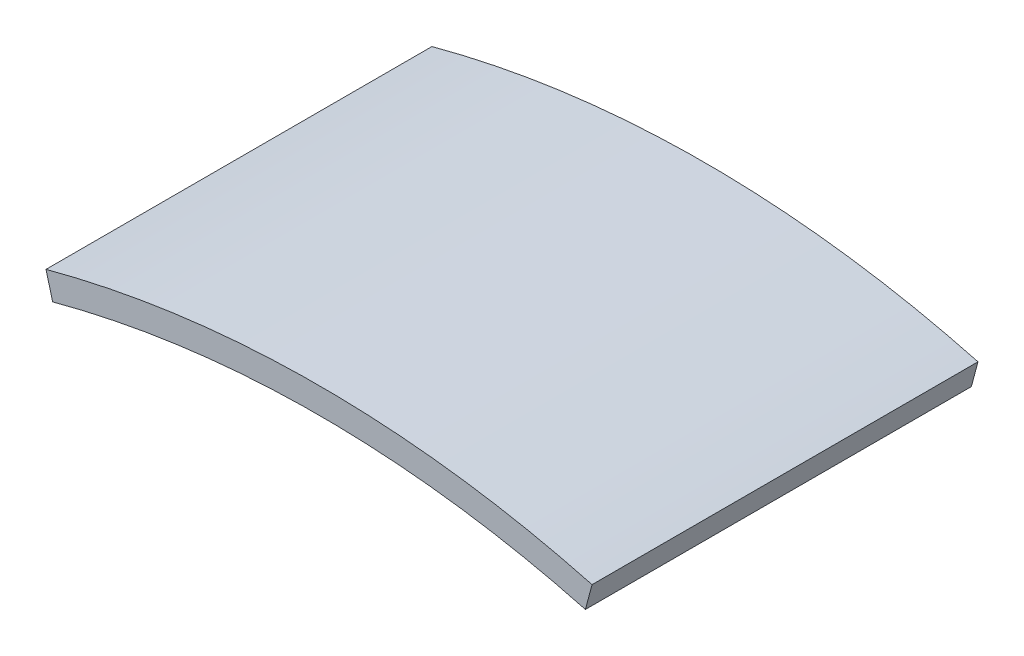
from build123d import *
from build123d.topology import SkipClean

# Parameters (mm, degrees)
EXTRUDE1_DEPTH = 15
SKETCH2_R      = 2.5
EXTRUDE3_DEPTH = 0.1


with BuildPart() as part:
    # Sketch1 → Extrude1 (new body)
    with BuildSketch(Plane.XY):
        with BuildLine():
            Line((50.352761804, 38.637033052), (50.611580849, 39.602958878))
            ThreePointArc((50.611580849, 39.602958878), (40, 41), (29.388419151, 39.602958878))
            Line((29.388419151, 39.602958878), (29.647238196, 38.637033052))
            ThreePointArc((29.647238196, 38.637033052), (40, 40), (50.352761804, 38.637033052))
        make_face()
    extrude(amount=EXTRUDE1_DEPTH)

    # Sketch2 → Extrude3 (cut)
    with SkipClean():  # the faces are left unmerged after this step: merging them gives an invalid solid
        with BuildSketch(Plane(origin=(0, 40, 0), x_dir=(-1, 0, 0), z_dir=(0, 1, 0))):
            with Locations((-40.002761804, 7.5)):
                Circle(SKETCH2_R)
        extrude(amount=-EXTRUDE3_DEPTH, mode=Mode.SUBTRACT)


solid = part.part
